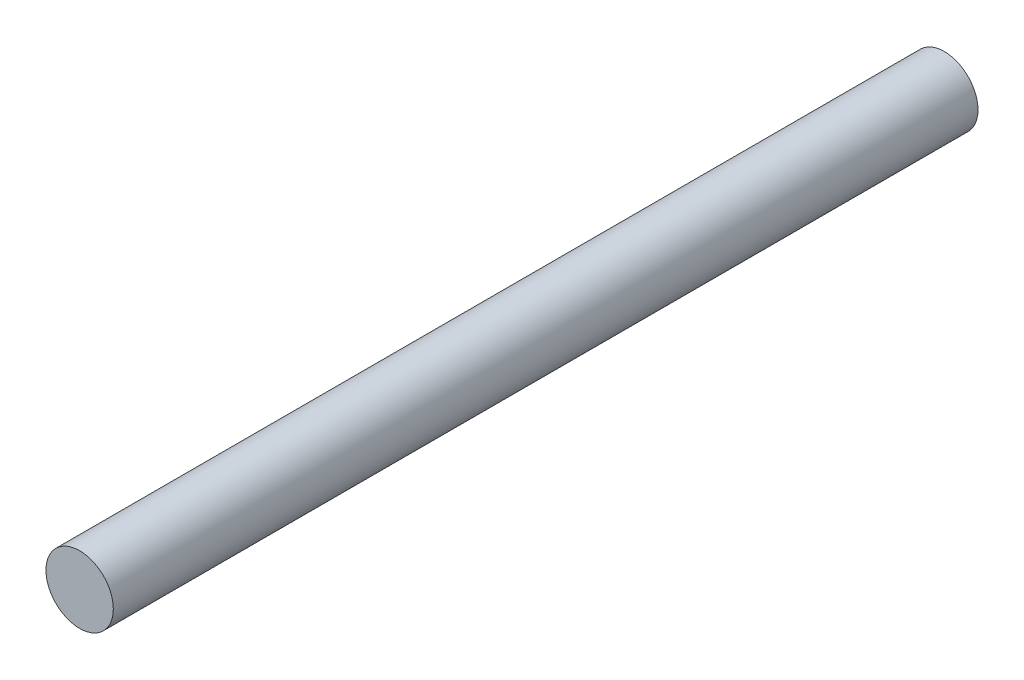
ISO-10303-21;
HEADER;
FILE_DESCRIPTION(('STEP AP214'),'2;1');
FILE_NAME('part.step','',(''),(''),'','','');
FILE_SCHEMA(('AUTOMOTIVE_DESIGN { 1 0 10303 214 1 1 1 1 }'));
ENDSEC;
DATA;
#1=APPLICATION_CONTEXT('core data for automotive mechanical design processes');
#2=APPLICATION_PROTOCOL_DEFINITION('international standard','automotive_design',2000,#1);
#3=PRODUCT_CONTEXT('',#1,'mechanical');
#4=PRODUCT('Part','Part','',(#3));
#5=PRODUCT_RELATED_PRODUCT_CATEGORY('part','',(#4));
#6=PRODUCT_DEFINITION_FORMATION('','',#4);
#7=PRODUCT_DEFINITION_CONTEXT('part definition',#1,'design');
#8=PRODUCT_DEFINITION('design','',#6,#7);
#9=PRODUCT_DEFINITION_SHAPE('','',#8);
#10=(LENGTH_UNIT() NAMED_UNIT(*) SI_UNIT(.MILLI.,.METRE.));
#11=(NAMED_UNIT(*) PLANE_ANGLE_UNIT() SI_UNIT($,.RADIAN.));
#12=(NAMED_UNIT(*) SI_UNIT($,.STERADIAN.) SOLID_ANGLE_UNIT());
#13=UNCERTAINTY_MEASURE_WITH_UNIT(LENGTH_MEASURE(1.E-05),#10,'distance_accuracy_value','');
#14=(GEOMETRIC_REPRESENTATION_CONTEXT(3) GLOBAL_UNCERTAINTY_ASSIGNED_CONTEXT((#13)) GLOBAL_UNIT_ASSIGNED_CONTEXT((#10,
#11,#12)) REPRESENTATION_CONTEXT('',''));
#15=CARTESIAN_POINT('',(0.,0.,0.));
#16=DIRECTION('',(0.,0.,1.));
#17=DIRECTION('',(1.,0.,0.));
#18=AXIS2_PLACEMENT_3D('',#15,#16,#17);
#19=CARTESIAN_POINT('',(0.,0.,0.));
#20=DIRECTION('',(0.,0.,-1.));
#21=DIRECTION('',(1.,0.,0.));
#22=AXIS2_PLACEMENT_3D('',#19,#20,#21);
#23=CYLINDRICAL_SURFACE('',#22,1.5);
#24=CARTESIAN_POINT('',(0.,0.,0.));
#25=DIRECTION('',(0.,0.,-1.));
#26=DIRECTION('',(1.,0.,0.));
#27=AXIS2_PLACEMENT_3D('',#24,#25,#26);
#28=CIRCLE('',#27,1.5);
#29=CARTESIAN_POINT('',(1.5,0.,0.));
#30=VERTEX_POINT('',#29);
#31=EDGE_CURVE('E8',#30,#30,#28,.T.);
#32=ORIENTED_EDGE('',*,*,#31,.F.);
#33=EDGE_LOOP('',(#32));
#34=FACE_BOUND('',#33,.T.);
#35=CARTESIAN_POINT('',(0.,0.,38.5));
#36=DIRECTION('',(0.,0.,-1.));
#37=DIRECTION('',(1.,0.,0.));
#38=AXIS2_PLACEMENT_3D('',#35,#36,#37);
#39=CIRCLE('',#38,1.5);
#40=CARTESIAN_POINT('',(1.5,0.,38.5));
#41=VERTEX_POINT('',#40);
#42=EDGE_CURVE('E18',#41,#41,#39,.T.);
#43=ORIENTED_EDGE('',*,*,#42,.T.);
#44=EDGE_LOOP('',(#43));
#45=FACE_BOUND('',#44,.T.);
#46=ADVANCED_FACE('F12',(#34,#45),#23,.T.);
#47=CARTESIAN_POINT('',(0.,-1.5,0.));
#48=DIRECTION('',(0.,0.,1.));
#49=DIRECTION('',(-1.,0.,0.));
#50=AXIS2_PLACEMENT_3D('',#47,#48,#49);
#51=PLANE('',#50);
#52=ORIENTED_EDGE('',*,*,#31,.T.);
#53=EDGE_LOOP('',(#52));
#54=FACE_BOUND('',#53,.T.);
#55=ADVANCED_FACE('F27',(#54),#51,.F.);
#56=CARTESIAN_POINT('',(0.,0.,38.5));
#57=DIRECTION('',(0.,0.,-1.));
#58=DIRECTION('',(1.,0.,0.));
#59=AXIS2_PLACEMENT_3D('',#56,#57,#58);
#60=PLANE('',#59);
#61=ORIENTED_EDGE('',*,*,#42,.F.);
#62=EDGE_LOOP('',(#61));
#63=FACE_BOUND('',#62,.T.);
#64=ADVANCED_FACE('F25',(#63),#60,.F.);
#65=CLOSED_SHELL('',(#46,#55,#64));
#66=MANIFOLD_SOLID_BREP('B1',#65);
#67=ADVANCED_BREP_SHAPE_REPRESENTATION('',(#18,#66),#14);
#68=SHAPE_DEFINITION_REPRESENTATION(#9,#67);
ENDSEC;
END-ISO-10303-21;
